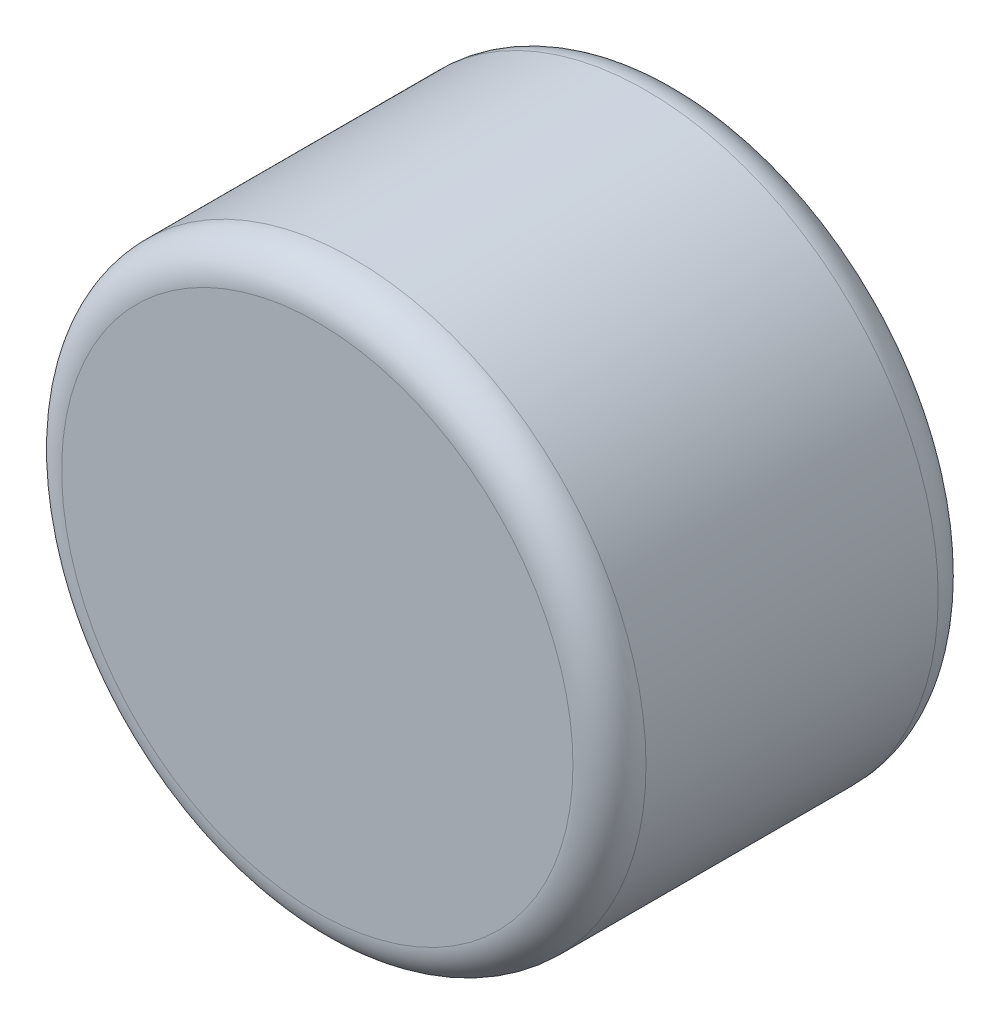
from build123d import *

# Parameters (mm, degrees)
ESQUISSE1_R        = 4
BOSS_EXTRU_1_DEPTH = 5
CONG_1_R           = 0.5


with BuildPart() as part:
    # Esquisse1 → Boss.-Extru.1 (new body)
    with BuildSketch(Plane.XY):
        Circle(ESQUISSE1_R)
    extrude(amount=BOSS_EXTRU_1_DEPTH)

    # Cong_1
    cong_1_edges = [part.edges().sort_by_distance(p)[0] for p in [
        (-4, 0, 0),
        (-4, 0, 5),
    ]]
    fillet(cong_1_edges, radius=CONG_1_R)


solid = part.part
